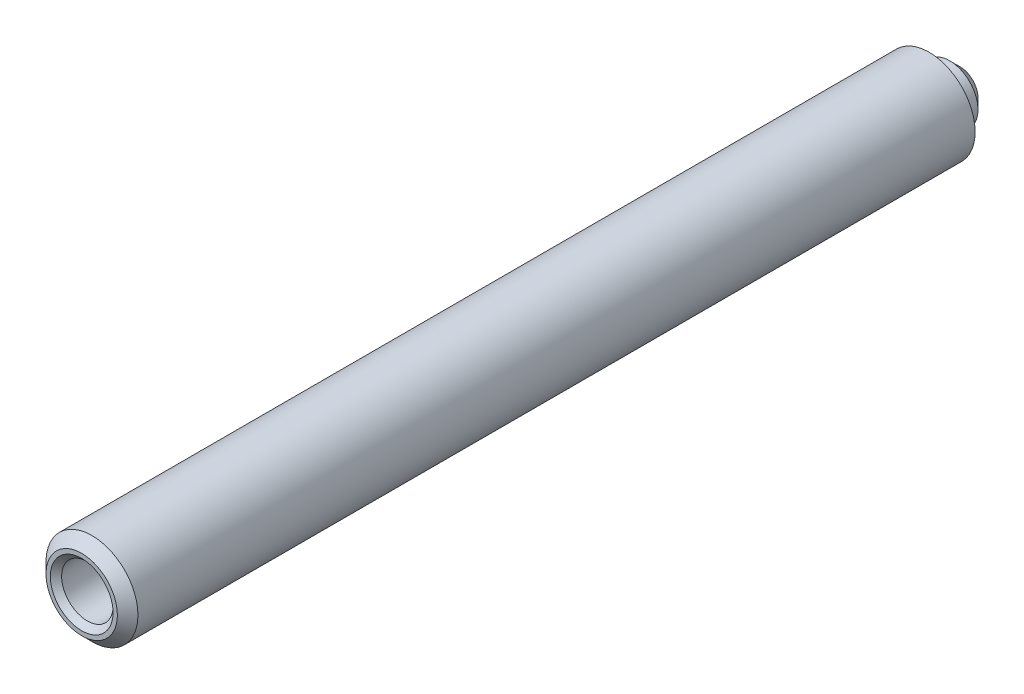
from build123d import *

# Parameters (mm, degrees)
ESQUISSE2_R                 = 1.3765
BOSS_EXTRU_1_DEPTH          = 1.5
ESQUISSE3_R                 = 2.235
BOSS_EXTRU_2_DEPTH          = 41.2
CHANFREIN1_SIZE             = 0.5
TROU_TARAUD_M31_D           = 2.5
TROU_TARAUD_M31_DEPTH       = 8.5
TROU_TARAUD_M31_CSINK_D     = 3.05
TROU_TARAUD_M31_CSINK_ANGLE = 90
TROU_TARAUD_M31_TIP         = 0.751075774


with BuildPart() as part:
    # Esquisse2 → Boss.-Extru.1 (new body)
    with BuildSketch(Plane(origin=(0, 0, -8), x_dir=(-1, 0, 0), z_dir=(0, 0, -1))):
        Circle(ESQUISSE2_R)
    extrude(amount=BOSS_EXTRU_1_DEPTH)

    # Esquisse3 → Boss.-Extru.2 (add)
    with BuildSketch(Plane.XY.offset(-8)):
        Circle(ESQUISSE3_R)
    extrude(amount=BOSS_EXTRU_2_DEPTH)

    # Chanfrein1
    chanfrein1_edges = [part.edges().sort_by_distance(p)[0] for p in [
        (1.3765, 0, -9.5),
        (-2.235, 0, 33.2),
    ]]
    chamfer(chanfrein1_edges, length=CHANFREIN1_SIZE)

    # Trou taraud_ M31
    with Locations(Plane.XY.offset(33.2)):
        with Locations((0, 0)):
            CounterSinkHole(TROU_TARAUD_M31_D / 2, TROU_TARAUD_M31_CSINK_D / 2, depth=TROU_TARAUD_M31_DEPTH, counter_sink_angle=TROU_TARAUD_M31_CSINK_ANGLE)
            with Locations((0, 0, -(TROU_TARAUD_M31_DEPTH + TROU_TARAUD_M31_TIP / 2))):  # 118° drill point
                Cone(0, TROU_TARAUD_M31_D / 2, TROU_TARAUD_M31_TIP, mode=Mode.SUBTRACT)


solid = part.part
